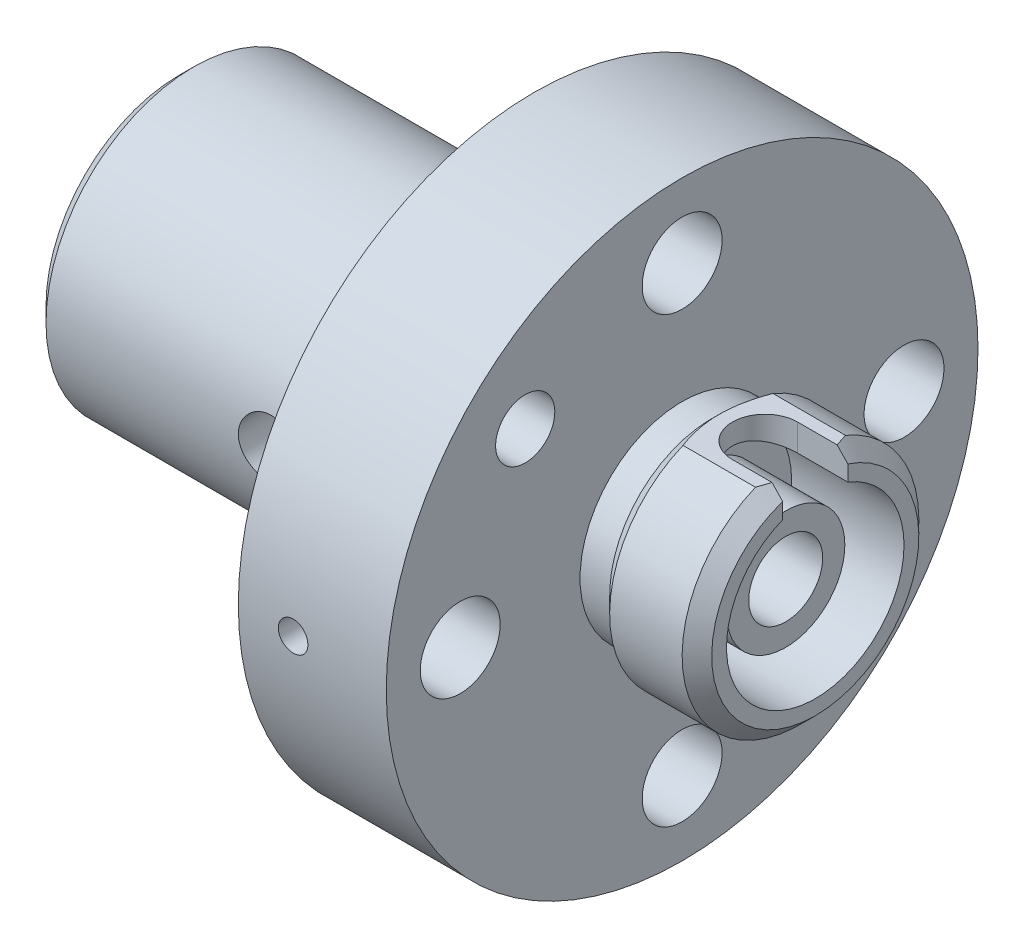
from build123d import *

# Parameters (mm, degrees)
LINEAR_AUSTRAGEN1_DEPTH          = 19.547236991
LINEAR_AUSTRAGEN1_DEPTH_BACK     = 19.547236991
SKIZZE2_W                        = 4.5
SKIZZE2_H                        = 0.8
LINEAR_AUSTRAGEN2_REACH          = 22.777
F_2_7_2_7_DURCHMESSER_BOHRUNG1_D = 2.7
KREISMUSTER1_COUNT               = 4
LINEAR_AUSTRAGEN3_REACH          = 24.113
SKIZZE6_R                        = 1
SKIZZE7_W                        = 4
SKIZZE7_H                        = 2
SKIZZE8_R                        = 1
LINEAR_AUSTRAGEN4_DEPTH          = 24.5
FASE1_SIZE                       = 0.5
SKIZZE9_R                        = 0.5
LINEAR_AUSTRAGEN5_DEPTH          = 44.5


with BuildPart() as part:
    # Skizze1 → Rotation1 (revolve)
    with BuildSketch(Plane.XY, mode=Mode.PRIVATE) as rotation1_sk:
        Polygon((-12, 1.25), (8.5, 1.25), (8.5, 2), (5.7, 2), (5.7, 3), (9.5, 3), (9.5, 3.5), (9, 4), (6.55, 4), (6, 3.45), (5, 3.45), (5, 10), (3, 10), (0, 10), (0, 5), (-12, 5), align=None)
    revolve(rotation1_sk.sketch.rotate(Axis((0, 0, 0), (-1, 0, 0)), 90), axis=Axis((0, 0, 0), (-1, 0, 0)))

    # Skizze2 → Linear austragen1 (cut, two sides: drawn at the far end of the back side and taken through both)
    with BuildSketch(Plane.XY.offset(-LINEAR_AUSTRAGEN1_DEPTH_BACK)):
        with Locations((7.25, 4.1)):
            Rectangle(SKIZZE2_W, SKIZZE2_H)
    extrude(amount=LINEAR_AUSTRAGEN1_DEPTH + LINEAR_AUSTRAGEN1_DEPTH_BACK, mode=Mode.SUBTRACT)

    # Skizze3 → Linear austragen2 (cut, up to next)
    with BuildSketch(Plane(origin=(0, 3.7, 0), x_dir=(1, 0, 0), z_dir=(0, 1, 0)), mode=Mode.PRIVATE) as linear_austragen2_sk1:
        with BuildLine():
            Line((9.5, -1.1), (9.5, 1.1))
            Line((9.5, 1.1), (7.8, 1.1))
            ThreePointArc((7.8, 1.1), (6.7, 0), (7.8, -1.1))
            Line((7.8, -1.1), (9.5, -1.1))
        make_face()
    linear_austragen2_tool1 = extrude(linear_austragen2_sk1.sketch, amount=-LINEAR_AUSTRAGEN2_REACH, mode=Mode.PRIVATE) & part.part
    add(linear_austragen2_tool1.solids().sort_by_distance((8.206276, 3.7, 0))[0], mode=Mode.SUBTRACT)

    # 2.7 _2.7_ Durchmesser Bohrung1 (through all)
    with Locations(Plane(origin=(5, -0.655089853, 0.855849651), x_dir=(0, 0, -1), z_dir=(1, 0, 0))):
        with Locations((0.855849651, 8.155089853)):
            f_2_7_2_7_durchmesser_bohrung1 = Hole(F_2_7_2_7_DURCHMESSER_BOHRUNG1_D / 2)

    # Kreismuster1: 2.7 _2.7_ Durchmesser Bohrung1 ×4 about axis
    kreismuster1_axis = Axis((0, 0, 0), (1, 0, 0))
    for i in range(1, KREISMUSTER1_COUNT):
        add(f_2_7_2_7_durchmesser_bohrung1.rotate(kreismuster1_axis, i * 360 / KREISMUSTER1_COUNT), mode=Mode.SUBTRACT)

    # Skizze6 → Linear austragen3 (cut, up to next)
    with BuildSketch(Plane(origin=(5, 0, 0), x_dir=(0, 0, -1), z_dir=(1, 0, 0)), mode=Mode.PRIVATE) as linear_austragen3_sk1:
        with Locations((-5.303300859, 5.303300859)):
            Circle(SKIZZE6_R)
    linear_austragen3_tool1 = extrude(linear_austragen3_sk1.sketch, amount=-LINEAR_AUSTRAGEN3_REACH, mode=Mode.PRIVATE) & part.part
    # Skizze6 → Linear austragen3 (cut, up to next)
    with BuildSketch(Plane(origin=(5, 0, 0), x_dir=(0, 0, -1), z_dir=(1, 0, 0)), mode=Mode.PRIVATE) as linear_austragen3_sk2:
        with Locations((4.301823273, -6.143640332)):
            Circle(SKIZZE6_R)
    linear_austragen3_tool2 = extrude(linear_austragen3_sk2.sketch, amount=-LINEAR_AUSTRAGEN3_REACH, mode=Mode.PRIVATE) & part.part
    add(linear_austragen3_tool1.solids().sort_by_distance((5, 5.303301, 5.303301))[0], mode=Mode.SUBTRACT)
    add(linear_austragen3_tool2.solids().sort_by_distance((5, -6.14364, -4.301823))[0], mode=Mode.SUBTRACT)

    # Skizze7 → Schnitt-Rotation1 (revolve, cut)
    with BuildSketch(Plane.XY, mode=Mode.PRIVATE) as schnitt_rotation1_sk:
        with Locations((-10, 1)):
            Rectangle(SKIZZE7_W, SKIZZE7_H)
    revolve(schnitt_rotation1_sk.sketch.rotate(Axis((0, 0, 0), (-1, 0, 0)), 90), axis=Axis((0, 0, 0), (-1, 0, 0)), mode=Mode.SUBTRACT)

    # Skizze8 → Linear austragen4 (cut, symmetric)
    with BuildSketch(Plane.XY):
        with Locations((-4, 0)):
            Circle(SKIZZE8_R)
    extrude(amount=LINEAR_AUSTRAGEN4_DEPTH, both=True, mode=Mode.SUBTRACT)

    # Fase1
    fase1_edges = [part.edges().sort_by_distance(p)[0] for p in [
        (-12, 0, 5),
    ]]
    chamfer(fase1_edges, length=FASE1_SIZE)

    # Skizze9 → Linear austragen5 (cut, symmetric)
    with BuildSketch(Plane.XY):
        with Locations((1.85, 0)):
            Circle(SKIZZE9_R)
    extrude(amount=LINEAR_AUSTRAGEN5_DEPTH, both=True, mode=Mode.SUBTRACT)


solid = part.part
